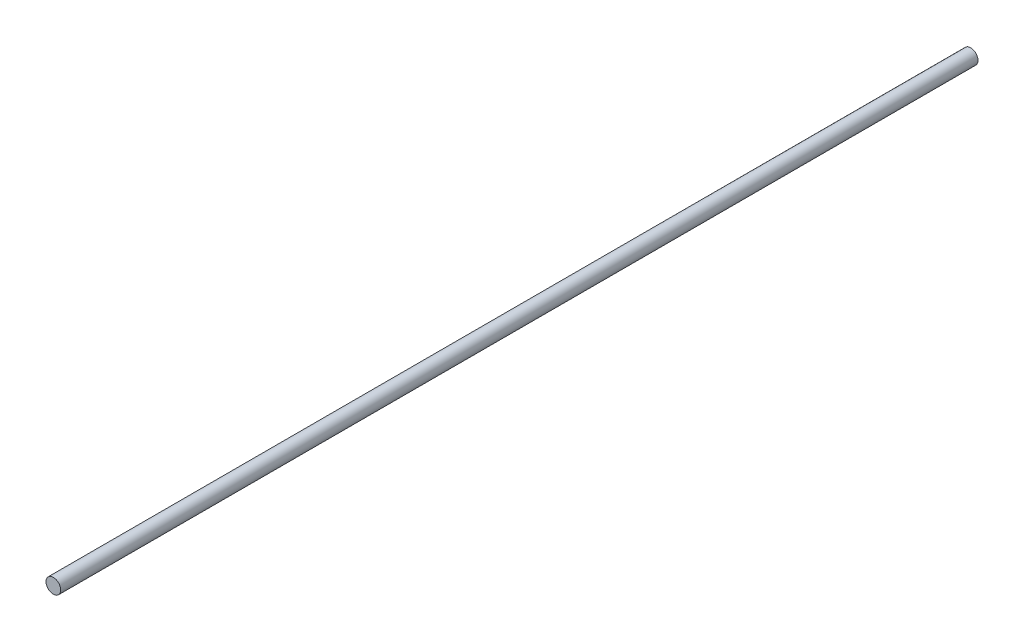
ISO-10303-21;
HEADER;
FILE_DESCRIPTION(('STEP AP214'),'2;1');
FILE_NAME('part.step','',(''),(''),'','','');
FILE_SCHEMA(('AUTOMOTIVE_DESIGN { 1 0 10303 214 1 1 1 1 }'));
ENDSEC;
DATA;
#1=APPLICATION_CONTEXT('core data for automotive mechanical design processes');
#2=APPLICATION_PROTOCOL_DEFINITION('international standard','automotive_design',2000,#1);
#3=PRODUCT_CONTEXT('',#1,'mechanical');
#4=PRODUCT('Part','Part','',(#3));
#5=PRODUCT_RELATED_PRODUCT_CATEGORY('part','',(#4));
#6=PRODUCT_DEFINITION_FORMATION('','',#4);
#7=PRODUCT_DEFINITION_CONTEXT('part definition',#1,'design');
#8=PRODUCT_DEFINITION('design','',#6,#7);
#9=PRODUCT_DEFINITION_SHAPE('','',#8);
#10=(LENGTH_UNIT() NAMED_UNIT(*) SI_UNIT(.MILLI.,.METRE.));
#11=(NAMED_UNIT(*) PLANE_ANGLE_UNIT() SI_UNIT($,.RADIAN.));
#12=(NAMED_UNIT(*) SI_UNIT($,.STERADIAN.) SOLID_ANGLE_UNIT());
#13=UNCERTAINTY_MEASURE_WITH_UNIT(LENGTH_MEASURE(1.E-05),#10,'distance_accuracy_value','');
#14=(GEOMETRIC_REPRESENTATION_CONTEXT(3) GLOBAL_UNCERTAINTY_ASSIGNED_CONTEXT((#13)) GLOBAL_UNIT_ASSIGNED_CONTEXT((#10,
#11,#12)) REPRESENTATION_CONTEXT('',''));
#15=CARTESIAN_POINT('',(0.,0.,0.));
#16=DIRECTION('',(0.,0.,1.));
#17=DIRECTION('',(1.,0.,0.));
#18=AXIS2_PLACEMENT_3D('',#15,#16,#17);
#19=CARTESIAN_POINT('',(0.,0.,1000.));
#20=DIRECTION('',(0.,0.,-1.));
#21=DIRECTION('',(-1.,0.,0.));
#22=AXIS2_PLACEMENT_3D('',#19,#20,#21);
#23=CYLINDRICAL_SURFACE('',#22,8.);
#24=CARTESIAN_POINT('',(0.,0.,1000.));
#25=DIRECTION('',(0.,0.,1.));
#26=DIRECTION('',(1.,0.,0.));
#27=AXIS2_PLACEMENT_3D('',#24,#25,#26);
#28=CIRCLE('',#27,8.);
#29=CARTESIAN_POINT('',(8.,0.,1000.));
#30=VERTEX_POINT('',#29);
#31=EDGE_CURVE('E10',#30,#30,#28,.T.);
#32=ORIENTED_EDGE('',*,*,#31,.F.);
#33=EDGE_LOOP('',(#32));
#34=FACE_BOUND('',#33,.T.);
#35=CARTESIAN_POINT('',(0.,0.,0.));
#36=DIRECTION('',(0.,0.,1.));
#37=DIRECTION('',(1.,0.,0.));
#38=AXIS2_PLACEMENT_3D('',#35,#36,#37);
#39=CIRCLE('',#38,8.);
#40=CARTESIAN_POINT('',(8.,0.,0.));
#41=VERTEX_POINT('',#40);
#42=EDGE_CURVE('E43',#41,#41,#39,.T.);
#43=ORIENTED_EDGE('',*,*,#42,.T.);
#44=EDGE_LOOP('',(#43));
#45=FACE_BOUND('',#44,.T.);
#46=ADVANCED_FACE('F40',(#34,#45),#23,.T.);
#47=CARTESIAN_POINT('',(0.,0.,1000.));
#48=DIRECTION('',(0.,0.,1.));
#49=DIRECTION('',(1.,0.,0.));
#50=AXIS2_PLACEMENT_3D('',#47,#48,#49);
#51=PLANE('',#50);
#52=ORIENTED_EDGE('',*,*,#31,.T.);
#53=EDGE_LOOP('',(#52));
#54=FACE_BOUND('',#53,.T.);
#55=ADVANCED_FACE('F55',(#54),#51,.T.);
#56=CARTESIAN_POINT('',(0.,0.,0.));
#57=DIRECTION('',(0.,0.,1.));
#58=DIRECTION('',(1.,0.,0.));
#59=AXIS2_PLACEMENT_3D('',#56,#57,#58);
#60=PLANE('',#59);
#61=ORIENTED_EDGE('',*,*,#42,.F.);
#62=EDGE_LOOP('',(#61));
#63=FACE_BOUND('',#62,.T.);
#64=ADVANCED_FACE('F53',(#63),#60,.F.);
#65=CLOSED_SHELL('',(#46,#55,#64));
#66=MANIFOLD_SOLID_BREP('B2',#65);
#67=ADVANCED_BREP_SHAPE_REPRESENTATION('',(#18,#66),#14);
#68=SHAPE_DEFINITION_REPRESENTATION(#9,#67);
ENDSEC;
END-ISO-10303-21;
